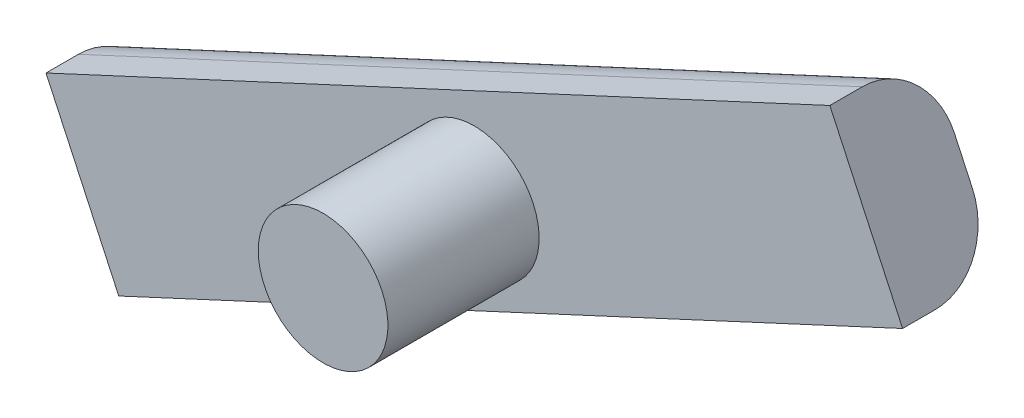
from build123d import *

# Parameters (mm, degrees)
VASTAGO_PROFILE_R = 3
GOMA_START        = 10.5
GOMA_DEPTH        = 4.5
REDONDEO2_R       = 3


with BuildPart() as part:
    # Vastago: sweep along a curve in space
    with BuildLine() as vastago_path:
        Line((455.341566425, 345.362620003, 22), (455.341566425, 345.362620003, 15))
    # Vastago profile (on start of the path) → Vastago (sweep)
    with BuildSketch(Plane(origin=(455.341566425, 345.362620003, 22), x_dir=(-1, 0, 0), z_dir=(0, 0, -1))):
        Circle(VASTAGO_PROFILE_R)
    sweep(path=vastago_path.line)

    # Sk_Goma → Goma (add)
    with BuildSketch(Plane.XY.offset(GOMA_START)):
        Polygon((438.883933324, 333.314951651), (435.516186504, 340.571554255), (471.799199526, 357.410288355), (475.166946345, 350.15368575), align=None)
    extrude(amount=GOMA_DEPTH)

    # Redondeo2
    redondeo2_edges = [part.edges().sort_by_distance(p)[0] for p in [
        (457.025439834, 341.734318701, 10.5),
        (453.657693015, 348.990921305, 10.5),
    ]]
    fillet(redondeo2_edges, radius=REDONDEO2_R)


solid = part.part
